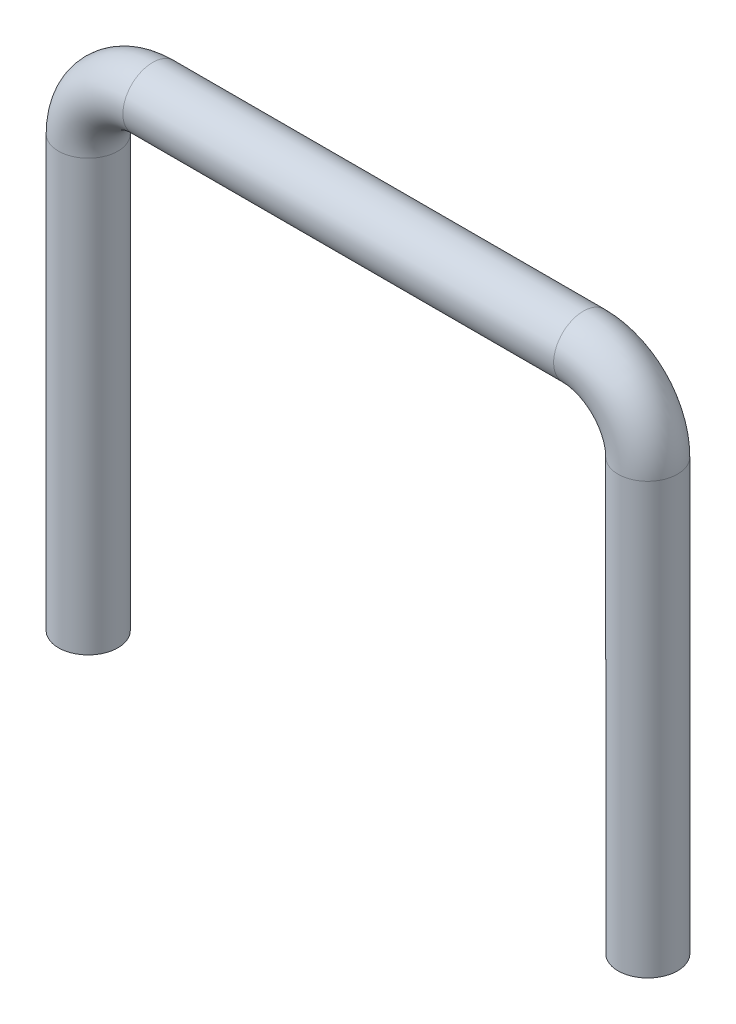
from build123d import *

# Parameters (mm, degrees)
ESQUISSE2_R   = 30
ESQUISSE2_R_2 = 6


with BuildPart() as part:
    # Base-Balayage: sweep along a path in Esquisse1
    with BuildLine(Plane.XY) as base_balayage_path:
        Line((0, 0), (0, 434))
        ThreePointArc((0, 434), (19.038059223, 479.961940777), (65, 499))
        Line((65, 499), (499.55, 499))
        ThreePointArc((499.55, 499), (545.511940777, 479.961940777), (564.55, 434))
        Line((564.55, 434), (564.55, 0))
    # Esquisse2 → Base-Balayage (sweep)
    with BuildSketch(Plane(origin=(0, 0, 0), x_dir=(1, 0, 0), z_dir=(0, 1, 0))):
        Circle(ESQUISSE2_R)
        Circle(ESQUISSE2_R_2, mode=Mode.SUBTRACT)
    sweep(path=base_balayage_path.line)


solid = part.part
